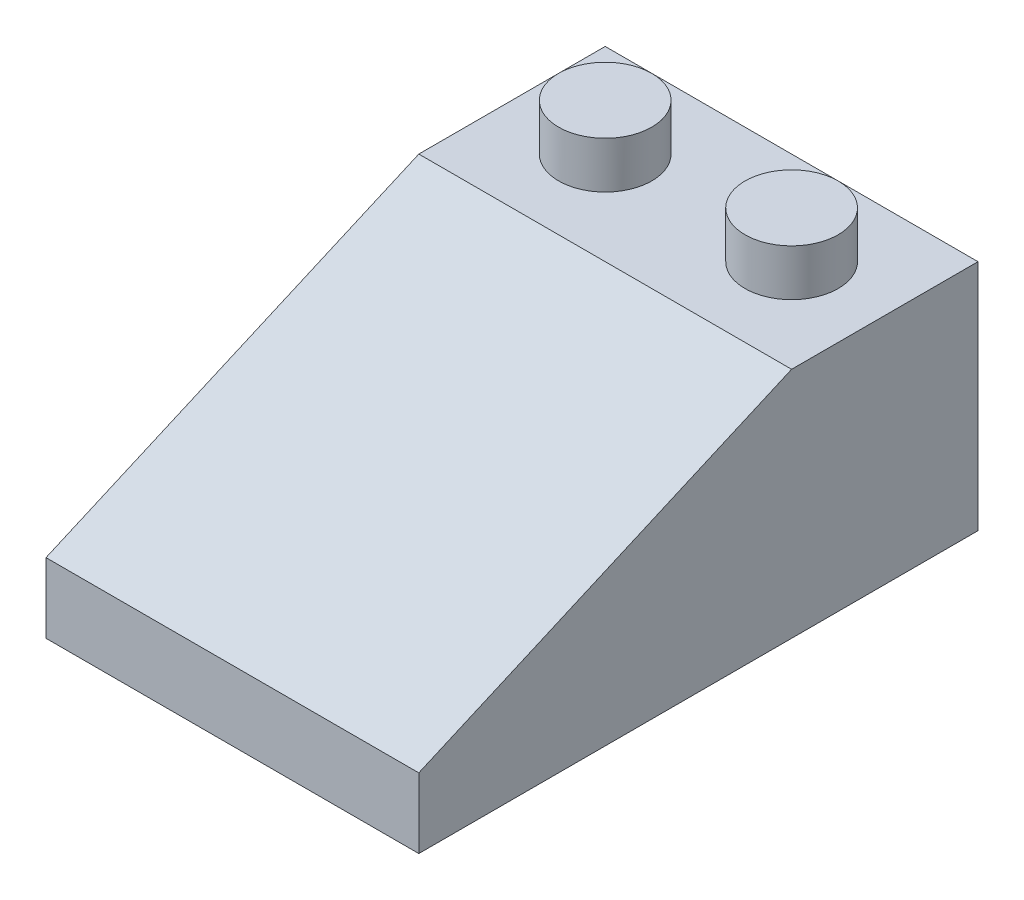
from build123d import *

# Parameters (mm, degrees)
SALIENTE_EXTRUIR1_DEPTH = 16
CROQUIS2_R              = 2
SALIENTE_EXTRUIR2_DEPTH = 2
VACIADO1_T              = -1
SALIENTE_EXTRUIR3_REACH = 33.241
CROQUIS6_R              = 2.7
CROQUIS6_R_2            = 1.7


with BuildPart() as part:
    # Croquis1 → Saliente-Extruir1 (new body)
    with BuildSketch(Plane(origin=(0, 0, 0), x_dir=(0, 0, -1), z_dir=(1, 0, 0))):
        Polygon((-8, 10), (-24, 3), (-24, 0), (0, 0), (0, 10), align=None)
    extrude(amount=SALIENTE_EXTRUIR1_DEPTH)

    # Croquis2 → Saliente-Extruir2 (add)
    with BuildSketch(Plane(origin=(0, 10, 0), x_dir=(1, 0, 0), z_dir=(0, 1, 0))):
        with Locations(Location((4, -4, 0), (0, 0, 90))):
            Circle(CROQUIS2_R)
        with Locations(Location((12, -4, 0), (0, 0, 90))):
            Circle(CROQUIS2_R)
    extrude(amount=SALIENTE_EXTRUIR2_DEPTH)

    # Vaciado1
    vaciado1_openings = [part.faces().sort_by_distance(p)[0] for p in [
        (8, 0, 12),
    ]]
    offset(amount=VACIADO1_T, openings=vaciado1_openings, kind=Kind.INTERSECTION)

    # Croquis6 → Saliente-Extruir3 (add, up to next)
    with BuildSketch(Plane.XZ, mode=Mode.PRIVATE) as saliente_extruir3_sk1:
        with Locations(Location((8, 8, 0), (0, 0, 270))):
            Circle(CROQUIS6_R)
        with Locations(Location((8, 8, 0), (0, 0, 270))):
            Circle(CROQUIS6_R_2, mode=Mode.SUBTRACT)
    saliente_extruir3_tool1 = extrude(saliente_extruir3_sk1.sketch, amount=-SALIENTE_EXTRUIR3_REACH, mode=Mode.PRIVATE) - part.part
    # Croquis6 → Saliente-Extruir3 (add, up to next)
    with BuildSketch(Plane.XZ, mode=Mode.PRIVATE) as saliente_extruir3_sk2:
        with Locations(Location((8, 16, 0), (0, 0, 90))):
            Circle(CROQUIS6_R)
        with Locations(Location((8, 16, 0), (0, 0, 90))):
            Circle(CROQUIS6_R_2, mode=Mode.SUBTRACT)
    saliente_extruir3_tool2 = extrude(saliente_extruir3_sk2.sketch, amount=-SALIENTE_EXTRUIR3_REACH, mode=Mode.PRIVATE) - part.part
    add(saliente_extruir3_tool1.solids().sort_by_distance((8, 0, 10.623632))[0])
    add(saliente_extruir3_tool2.solids().sort_by_distance((8, 0, 13.376368))[0])


solid = part.part
